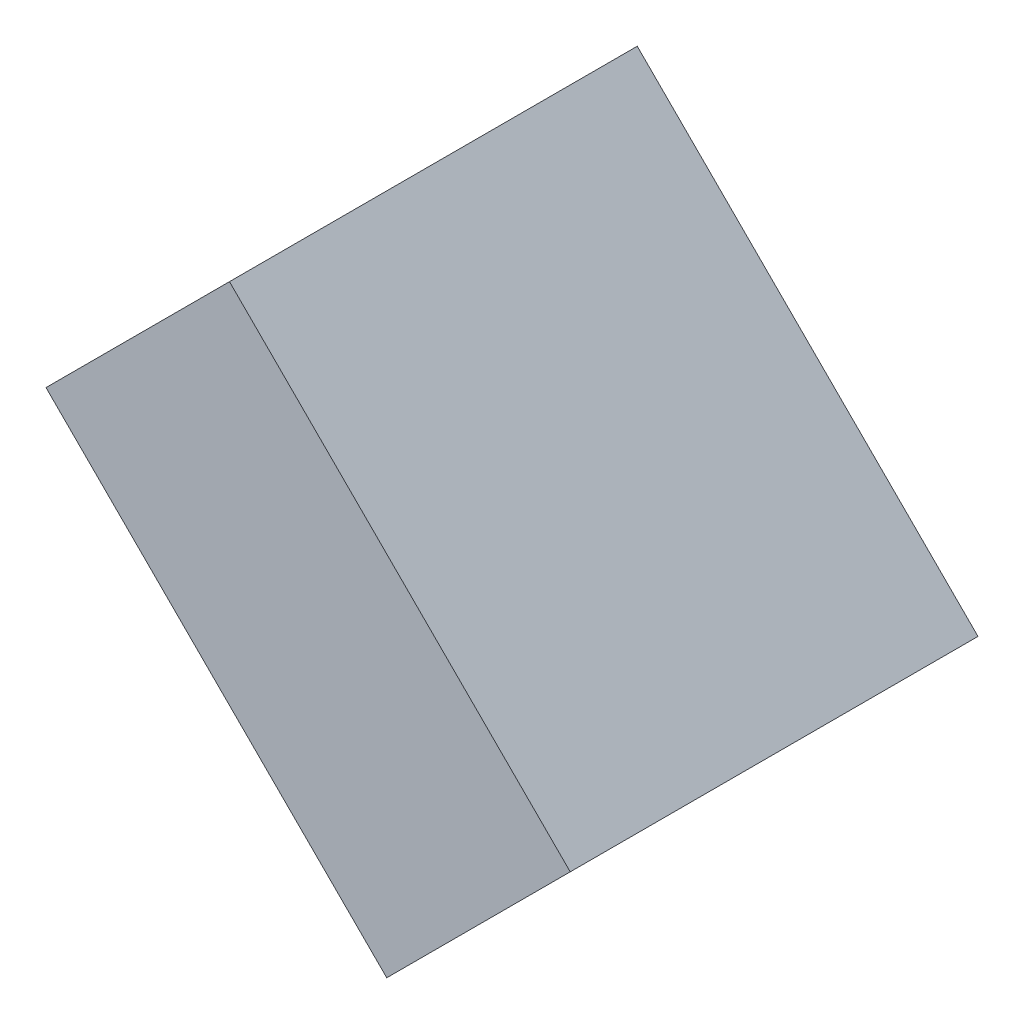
ISO-10303-21;
HEADER;
FILE_DESCRIPTION(('STEP AP214'),'2;1');
FILE_NAME('part.step','',(''),(''),'','','');
FILE_SCHEMA(('AUTOMOTIVE_DESIGN { 1 0 10303 214 1 1 1 1 }'));
ENDSEC;
DATA;
#1=APPLICATION_CONTEXT('core data for automotive mechanical design processes');
#2=APPLICATION_PROTOCOL_DEFINITION('international standard','automotive_design',2000,#1);
#3=PRODUCT_CONTEXT('',#1,'mechanical');
#4=PRODUCT('Part','Part','',(#3));
#5=PRODUCT_RELATED_PRODUCT_CATEGORY('part','',(#4));
#6=PRODUCT_DEFINITION_FORMATION('','',#4);
#7=PRODUCT_DEFINITION_CONTEXT('part definition',#1,'design');
#8=PRODUCT_DEFINITION('design','',#6,#7);
#9=PRODUCT_DEFINITION_SHAPE('','',#8);
#10=(LENGTH_UNIT() NAMED_UNIT(*) SI_UNIT(.MILLI.,.METRE.));
#11=(NAMED_UNIT(*) PLANE_ANGLE_UNIT() SI_UNIT($,.RADIAN.));
#12=(NAMED_UNIT(*) SI_UNIT($,.STERADIAN.) SOLID_ANGLE_UNIT());
#13=UNCERTAINTY_MEASURE_WITH_UNIT(LENGTH_MEASURE(1.E-05),#10,'distance_accuracy_value','');
#14=(GEOMETRIC_REPRESENTATION_CONTEXT(3) GLOBAL_UNCERTAINTY_ASSIGNED_CONTEXT((#13)) GLOBAL_UNIT_ASSIGNED_CONTEXT((#10,
#11,#12)) REPRESENTATION_CONTEXT('',''));
#15=CARTESIAN_POINT('',(0.,0.,0.));
#16=DIRECTION('',(0.,0.,1.));
#17=DIRECTION('',(1.,0.,0.));
#18=AXIS2_PLACEMENT_3D('',#15,#16,#17);
#19=CARTESIAN_POINT('',(1.269999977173E-06,1.269999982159E-06,0.5499989));
#20=DIRECTION('',(0.,0.,1.));
#21=DIRECTION('',(1.,0.,0.));
#22=AXIS2_PLACEMENT_3D('',#19,#20,#21);
#23=PLANE('',#22);
#24=DIRECTION('',(0.707106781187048,0.707106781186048,0.));
#25=VECTOR('',#24,1.);
#26=CARTESIAN_POINT('',(0.10606786,-0.35355276,0.5499989));
#27=LINE('',#26,#25);
#28=CARTESIAN_POINT('',(0.10606786,-0.35355276,0.5499989));
#29=VERTEX_POINT('',#28);
#30=CARTESIAN_POINT('',(0.3535553,-0.10606532,0.5499989));
#31=VERTEX_POINT('',#30);
#32=EDGE_CURVE('E93',#29,#31,#27,.T.);
#33=ORIENTED_EDGE('',*,*,#32,.T.);
#34=DIRECTION('',(-0.707106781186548,0.707106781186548,0.));
#35=VECTOR('',#34,1.);
#36=CARTESIAN_POINT('',(0.3535553,-0.10606532,0.5499989));
#37=LINE('',#36,#35);
#38=CARTESIAN_POINT('',(-0.10606532,0.3535553,0.5499989));
#39=VERTEX_POINT('',#38);
#40=EDGE_CURVE('E72',#31,#39,#37,.T.);
#41=ORIENTED_EDGE('',*,*,#40,.T.);
#42=DIRECTION('',(-0.707106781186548,-0.707106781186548,0.));
#43=VECTOR('',#42,1.);
#44=CARTESIAN_POINT('',(-0.10606532,0.3535553,0.5499989));
#45=LINE('',#44,#43);
#46=CARTESIAN_POINT('',(-0.35355276,0.10606786,0.5499989));
#47=VERTEX_POINT('',#46);
#48=EDGE_CURVE('E77',#39,#47,#45,.T.);
#49=ORIENTED_EDGE('',*,*,#48,.T.);
#50=DIRECTION('',(0.707106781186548,-0.707106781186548,0.));
#51=VECTOR('',#50,1.);
#52=CARTESIAN_POINT('',(-0.35355276,0.10606786,0.5499989));
#53=LINE('',#52,#51);
#54=EDGE_CURVE('E11',#47,#29,#53,.T.);
#55=ORIENTED_EDGE('',*,*,#54,.T.);
#56=EDGE_LOOP('',(#33,#41,#49,#55));
#57=FACE_BOUND('',#56,.T.);
#58=ADVANCED_FACE('F17',(#57),#23,.T.);
#59=CARTESIAN_POINT('',(1.269999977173E-06,1.269999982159E-06,0.));
#60=DIRECTION('',(0.,0.,1.));
#61=DIRECTION('',(1.,0.,0.));
#62=AXIS2_PLACEMENT_3D('',#59,#60,#61);
#63=PLANE('',#62);
#64=DIRECTION('',(0.707106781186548,-0.707106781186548,0.));
#65=VECTOR('',#64,1.);
#66=CARTESIAN_POINT('',(-0.35355276,0.10606786,0.));
#67=LINE('',#66,#65);
#68=CARTESIAN_POINT('',(-0.35355276,0.10606786,0.));
#69=VERTEX_POINT('',#68);
#70=CARTESIAN_POINT('',(0.10606786,-0.35355276,0.));
#71=VERTEX_POINT('',#70);
#72=EDGE_CURVE('E26',#69,#71,#67,.T.);
#73=ORIENTED_EDGE('',*,*,#72,.F.);
#74=DIRECTION('',(-0.707106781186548,-0.707106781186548,0.));
#75=VECTOR('',#74,1.);
#76=CARTESIAN_POINT('',(-0.10606532,0.3535553,0.));
#77=LINE('',#76,#75);
#78=CARTESIAN_POINT('',(-0.10606532,0.3535553,0.));
#79=VERTEX_POINT('',#78);
#80=EDGE_CURVE('E60',#79,#69,#77,.T.);
#81=ORIENTED_EDGE('',*,*,#80,.F.);
#82=DIRECTION('',(-0.707106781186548,0.707106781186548,0.));
#83=VECTOR('',#82,1.);
#84=CARTESIAN_POINT('',(0.3535553,-0.10606532,0.));
#85=LINE('',#84,#83);
#86=CARTESIAN_POINT('',(0.3535553,-0.10606532,0.));
#87=VERTEX_POINT('',#86);
#88=EDGE_CURVE('E65',#87,#79,#85,.T.);
#89=ORIENTED_EDGE('',*,*,#88,.F.);
#90=DIRECTION('',(0.707106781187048,0.707106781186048,0.));
#91=VECTOR('',#90,1.);
#92=CARTESIAN_POINT('',(0.10606786,-0.35355276,0.));
#93=LINE('',#92,#91);
#94=EDGE_CURVE('E112',#71,#87,#93,.T.);
#95=ORIENTED_EDGE('',*,*,#94,.F.);
#96=EDGE_LOOP('',(#73,#81,#89,#95));
#97=FACE_BOUND('',#96,.T.);
#98=ADVANCED_FACE('F62',(#97),#63,.F.);
#99=CARTESIAN_POINT('',(-0.35355276,0.10606786,0.));
#100=DIRECTION('',(0.707106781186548,0.707106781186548,0.));
#101=DIRECTION('',(0.,0.,-1.));
#102=AXIS2_PLACEMENT_3D('',#99,#100,#101);
#103=PLANE('',#102);
#104=ORIENTED_EDGE('',*,*,#72,.T.);
#105=DIRECTION('',(0.,0.,1.));
#106=VECTOR('',#105,1.);
#107=CARTESIAN_POINT('',(0.10606786,-0.35355276,0.));
#108=LINE('',#107,#106);
#109=EDGE_CURVE('E87',#71,#29,#108,.T.);
#110=ORIENTED_EDGE('',*,*,#109,.T.);
#111=ORIENTED_EDGE('',*,*,#54,.F.);
#112=DIRECTION('',(0.,0.,1.));
#113=VECTOR('',#112,1.);
#114=CARTESIAN_POINT('',(-0.35355276,0.10606786,0.));
#115=LINE('',#114,#113);
#116=EDGE_CURVE('E71',#69,#47,#115,.T.);
#117=ORIENTED_EDGE('',*,*,#116,.F.);
#118=EDGE_LOOP('',(#104,#110,#111,#117));
#119=FACE_BOUND('',#118,.T.);
#120=ADVANCED_FACE('F136',(#119),#103,.F.);
#121=CARTESIAN_POINT('',(-0.10606532,0.3535553,0.));
#122=DIRECTION('',(0.707106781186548,-0.707106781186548,0.));
#123=DIRECTION('',(0.,0.,-1.));
#124=AXIS2_PLACEMENT_3D('',#121,#122,#123);
#125=PLANE('',#124);
#126=ORIENTED_EDGE('',*,*,#80,.T.);
#127=ORIENTED_EDGE('',*,*,#116,.T.);
#128=ORIENTED_EDGE('',*,*,#48,.F.);
#129=DIRECTION('',(0.,0.,1.));
#130=VECTOR('',#129,1.);
#131=CARTESIAN_POINT('',(-0.10606532,0.3535553,0.));
#132=LINE('',#131,#130);
#133=EDGE_CURVE('E75',#79,#39,#132,.T.);
#134=ORIENTED_EDGE('',*,*,#133,.F.);
#135=EDGE_LOOP('',(#126,#127,#128,#134));
#136=FACE_BOUND('',#135,.T.);
#137=ADVANCED_FACE('F76',(#136),#125,.F.);
#138=CARTESIAN_POINT('',(0.3535553,-0.10606532,0.));
#139=DIRECTION('',(-0.707106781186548,-0.707106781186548,0.));
#140=DIRECTION('',(-0.707106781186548,0.707106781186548,0.));
#141=AXIS2_PLACEMENT_3D('',#138,#139,#140);
#142=PLANE('',#141);
#143=ORIENTED_EDGE('',*,*,#88,.T.);
#144=ORIENTED_EDGE('',*,*,#133,.T.);
#145=ORIENTED_EDGE('',*,*,#40,.F.);
#146=DIRECTION('',(0.,0.,1.));
#147=VECTOR('',#146,1.);
#148=CARTESIAN_POINT('',(0.3535553,-0.10606532,0.));
#149=LINE('',#148,#147);
#150=EDGE_CURVE('E84',#87,#31,#149,.T.);
#151=ORIENTED_EDGE('',*,*,#150,.F.);
#152=EDGE_LOOP('',(#143,#144,#145,#151));
#153=FACE_BOUND('',#152,.T.);
#154=ADVANCED_FACE('F82',(#153),#142,.F.);
#155=CARTESIAN_POINT('',(0.10606786,-0.35355276,0.));
#156=DIRECTION('',(-0.707106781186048,0.707106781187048,0.));
#157=DIRECTION('',(0.,0.,1.));
#158=AXIS2_PLACEMENT_3D('',#155,#156,#157);
#159=PLANE('',#158);
#160=ORIENTED_EDGE('',*,*,#94,.T.);
#161=ORIENTED_EDGE('',*,*,#150,.T.);
#162=ORIENTED_EDGE('',*,*,#32,.F.);
#163=ORIENTED_EDGE('',*,*,#109,.F.);
#164=EDGE_LOOP('',(#160,#161,#162,#163));
#165=FACE_BOUND('',#164,.T.);
#166=ADVANCED_FACE('F118',(#165),#159,.F.);
#167=CLOSED_SHELL('',(#58,#98,#120,#137,#154,#166));
#168=MANIFOLD_SOLID_BREP('B1',#167);
#169=ADVANCED_BREP_SHAPE_REPRESENTATION('',(#18,#168),#14);
#170=SHAPE_DEFINITION_REPRESENTATION(#9,#169);
ENDSEC;
END-ISO-10303-21;
